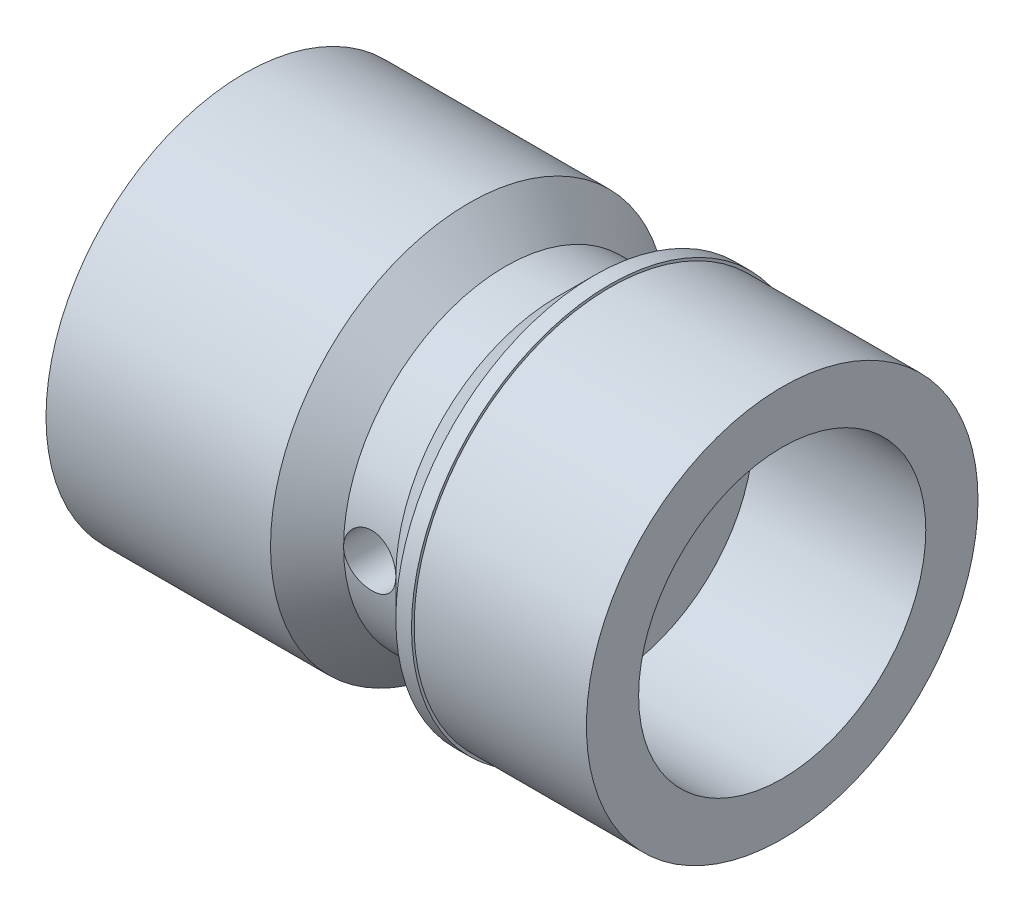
from build123d import *

# Parameters (mm, degrees)
SKETCH2_R           = 0.635
CUT_EXTRUDE1_DEPTH  = 11.18378466
SKETCH3_R           = 4.7625
SKETCH3_R_2         = 3.4925
BOSS_EXTRUDE1_DEPTH = 4.191
SKETCH5_R           = 4.826
BOSS_EXTRUDE2_DEPTH = 5.08
CUT_EXTRUDE3_DEPTH  = 5.08


with BuildPart() as part:
    # Sketch1 → Revolve1 (revolve)
    with BuildSketch(Plane.XY, mode=Mode.PRIVATE) as revolve1_sk:
        Polygon((1.905, 0), (-1.905, 0), (-1.905, 4.826), (-1.524, 4.826), (-0.635, 3.937), (0.635, 3.937), (1.524, 4.826), (1.905, 4.826), align=None)
    revolve(revolve1_sk.sketch.rotate(Axis((1.905, 0, 0), (-1, 0, 0)), 90), axis=Axis((1.905, 0, 0), (-1, 0, 0)))

    # Sketch2 → Cut-Extrude1 (cut, through all)
    with BuildSketch(Plane.XY.offset(3.937)):
        Circle(SKETCH2_R)
    extrude(amount=-CUT_EXTRUDE1_DEPTH, mode=Mode.SUBTRACT)

    # Sketch3 → Boss-Extrude1 (add)
    with BuildSketch(Plane(origin=(1.905, 0, 0), x_dir=(0, 0, -1), z_dir=(1, 0, 0))):
        Circle(SKETCH3_R)
        Circle(SKETCH3_R_2, mode=Mode.SUBTRACT)
    extrude(amount=BOSS_EXTRUDE1_DEPTH)

    # Sketch5 → Boss-Extrude2 (add)
    with BuildSketch(Plane.ZY.offset(1.905)):
        with Locations(Location((0, 0, 0), (0, 0, 180))):
            Circle(SKETCH5_R)
    extrude(amount=BOSS_EXTRUDE2_DEPTH)

    # Sketch6 → Cut-Extrude3 (cut)
    with BuildSketch(Plane.ZY.offset(6.985)):
        Polygon((1.443375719, 0), (0.72168786, 1.25000004), (-0.72168786, 1.25000004), (-1.443375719, 0), (-0.72168786, -1.25000004), (0.72168786, -1.25000004), align=None)
    extrude(amount=-CUT_EXTRUDE3_DEPTH, mode=Mode.SUBTRACT)


solid = part.part
